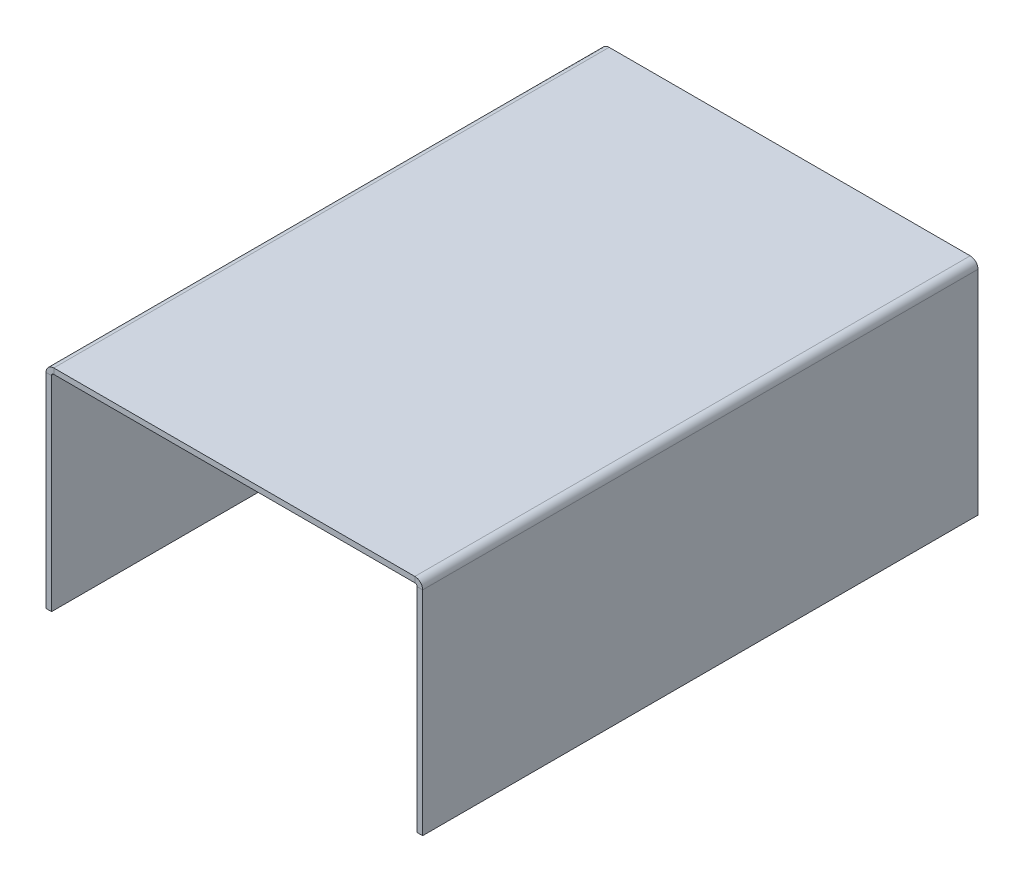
ISO-10303-21;
HEADER;
FILE_DESCRIPTION(('STEP AP214'),'2;1');
FILE_NAME('part.step','',(''),(''),'','','');
FILE_SCHEMA(('AUTOMOTIVE_DESIGN { 1 0 10303 214 1 1 1 1 }'));
ENDSEC;
DATA;
#1=APPLICATION_CONTEXT('core data for automotive mechanical design processes');
#2=APPLICATION_PROTOCOL_DEFINITION('international standard','automotive_design',2000,#1);
#3=PRODUCT_CONTEXT('',#1,'mechanical');
#4=PRODUCT('Part','Part','',(#3));
#5=PRODUCT_RELATED_PRODUCT_CATEGORY('part','',(#4));
#6=PRODUCT_DEFINITION_FORMATION('','',#4);
#7=PRODUCT_DEFINITION_CONTEXT('part definition',#1,'design');
#8=PRODUCT_DEFINITION('design','',#6,#7);
#9=PRODUCT_DEFINITION_SHAPE('','',#8);
#10=(LENGTH_UNIT() NAMED_UNIT(*) SI_UNIT(.MILLI.,.METRE.));
#11=(NAMED_UNIT(*) PLANE_ANGLE_UNIT() SI_UNIT($,.RADIAN.));
#12=(NAMED_UNIT(*) SI_UNIT($,.STERADIAN.) SOLID_ANGLE_UNIT());
#13=UNCERTAINTY_MEASURE_WITH_UNIT(LENGTH_MEASURE(1.E-05),#10,'distance_accuracy_value','');
#14=(GEOMETRIC_REPRESENTATION_CONTEXT(3) GLOBAL_UNCERTAINTY_ASSIGNED_CONTEXT((#13)) GLOBAL_UNIT_ASSIGNED_CONTEXT((#10,
#11,#12)) REPRESENTATION_CONTEXT('',''));
#15=CARTESIAN_POINT('',(0.,0.,0.));
#16=DIRECTION('',(0.,0.,1.));
#17=DIRECTION('',(1.,0.,0.));
#18=AXIS2_PLACEMENT_3D('',#15,#16,#17);
#19=CARTESIAN_POINT('',(-82.5763046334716,97.0504840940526,127.));
#20=DIRECTION('',(0.,0.,1.));
#21=DIRECTION('',(1.,0.,0.));
#22=AXIS2_PLACEMENT_3D('',#19,#20,#21);
#23=PLANE('',#22);
#24=DIRECTION('',(0.,-1.,0.));
#25=VECTOR('',#24,1.);
#26=CARTESIAN_POINT('',(-82.5763046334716,97.0504840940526,127.));
#27=LINE('',#26,#25);
#28=CARTESIAN_POINT('',(-82.5763046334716,97.0504840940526,127.));
#29=VERTEX_POINT('',#28);
#30=CARTESIAN_POINT('',(-82.5763046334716,94.5104840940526,127.));
#31=VERTEX_POINT('',#30);
#32=EDGE_CURVE('E11',#29,#31,#27,.T.);
#33=ORIENTED_EDGE('',*,*,#32,.F.);
#34=CARTESIAN_POINT('',(-82.5763046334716,93.4944840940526,127.));
#35=DIRECTION('',(0.,0.,1.));
#36=DIRECTION('',(1.,0.,0.));
#37=AXIS2_PLACEMENT_3D('',#34,#35,#36);
#38=CIRCLE('',#37,3.556);
#39=CARTESIAN_POINT('',(-86.1323046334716,93.4944840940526,127.));
#40=VERTEX_POINT('',#39);
#41=EDGE_CURVE('E189',#40,#29,#38,.F.);
#42=ORIENTED_EDGE('',*,*,#41,.F.);
#43=DIRECTION('',(-1.,0.,0.));
#44=VECTOR('',#43,1.);
#45=CARTESIAN_POINT('',(-83.5923046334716,93.4944840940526,127.));
#46=LINE('',#45,#44);
#47=CARTESIAN_POINT('',(-83.5923046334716,93.4944840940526,127.));
#48=VERTEX_POINT('',#47);
#49=EDGE_CURVE('E42',#48,#40,#46,.T.);
#50=ORIENTED_EDGE('',*,*,#49,.F.);
#51=CARTESIAN_POINT('',(-82.5763046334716,93.4944840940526,127.));
#52=DIRECTION('',(0.,0.,1.));
#53=DIRECTION('',(1.,0.,0.));
#54=AXIS2_PLACEMENT_3D('',#51,#52,#53);
#55=CIRCLE('',#54,1.016);
#56=EDGE_CURVE('E201',#48,#31,#55,.F.);
#57=ORIENTED_EDGE('',*,*,#56,.T.);
#58=EDGE_LOOP('',(#33,#42,#50,#57));
#59=FACE_BOUND('',#58,.T.);
#60=ADVANCED_FACE('F35',(#59),#23,.T.);
#61=CARTESIAN_POINT('',(-83.5923046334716,93.4944840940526,127.));
#62=DIRECTION('',(0.,0.,1.));
#63=DIRECTION('',(1.,0.,0.));
#64=AXIS2_PLACEMENT_3D('',#61,#62,#63);
#65=PLANE('',#64);
#66=DIRECTION('',(1.,0.,0.));
#67=VECTOR('',#66,1.);
#68=CARTESIAN_POINT('',(-86.1323046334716,97.0504840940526,127.));
#69=LINE('',#68,#67);
#70=CARTESIAN_POINT('',(82.5763046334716,97.0504840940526,127.));
#71=VERTEX_POINT('',#70);
#72=EDGE_CURVE('E186',#29,#71,#69,.T.);
#73=ORIENTED_EDGE('',*,*,#72,.F.);
#74=ORIENTED_EDGE('',*,*,#32,.T.);
#75=DIRECTION('',(1.,0.,0.));
#76=VECTOR('',#75,1.);
#77=CARTESIAN_POINT('',(-86.1323046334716,94.5104840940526,127.));
#78=LINE('',#77,#76);
#79=CARTESIAN_POINT('',(82.5763046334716,94.5104840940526,127.));
#80=VERTEX_POINT('',#79);
#81=EDGE_CURVE('E204',#31,#80,#78,.T.);
#82=ORIENTED_EDGE('',*,*,#81,.T.);
#83=DIRECTION('',(0.,1.,0.));
#84=VECTOR('',#83,1.);
#85=CARTESIAN_POINT('',(82.5763046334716,94.5104840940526,127.));
#86=LINE('',#85,#84);
#87=EDGE_CURVE('E56',#80,#71,#86,.T.);
#88=ORIENTED_EDGE('',*,*,#87,.T.);
#89=EDGE_LOOP('',(#73,#74,#82,#88));
#90=FACE_BOUND('',#89,.T.);
#91=ADVANCED_FACE('F280',(#90),#65,.T.);
#92=CARTESIAN_POINT('',(-86.1323046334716,93.4944840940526,-127.));
#93=DIRECTION('',(0.,0.,-1.));
#94=DIRECTION('',(-1.,0.,0.));
#95=AXIS2_PLACEMENT_3D('',#92,#93,#94);
#96=PLANE('',#95);
#97=DIRECTION('',(1.,0.,0.));
#98=VECTOR('',#97,1.);
#99=CARTESIAN_POINT('',(-86.1323046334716,93.4944840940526,-127.));
#100=LINE('',#99,#98);
#101=CARTESIAN_POINT('',(-86.1323046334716,93.4944840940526,-127.));
#102=VERTEX_POINT('',#101);
#103=CARTESIAN_POINT('',(-83.5923046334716,93.4944840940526,-127.));
#104=VERTEX_POINT('',#103);
#105=EDGE_CURVE('E242',#102,#104,#100,.T.);
#106=ORIENTED_EDGE('',*,*,#105,.F.);
#107=CARTESIAN_POINT('',(-82.5763046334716,93.4944840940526,-127.));
#108=DIRECTION('',(0.,0.,1.));
#109=DIRECTION('',(1.,0.,0.));
#110=AXIS2_PLACEMENT_3D('',#107,#108,#109);
#111=CIRCLE('',#110,3.556);
#112=CARTESIAN_POINT('',(-82.5763046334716,97.0504840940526,-127.));
#113=VERTEX_POINT('',#112);
#114=EDGE_CURVE('E157',#102,#113,#111,.F.);
#115=ORIENTED_EDGE('',*,*,#114,.T.);
#116=DIRECTION('',(0.,1.,0.));
#117=VECTOR('',#116,1.);
#118=CARTESIAN_POINT('',(-82.5763046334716,94.5104840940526,-127.));
#119=LINE('',#118,#117);
#120=CARTESIAN_POINT('',(-82.5763046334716,94.5104840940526,-127.));
#121=VERTEX_POINT('',#120);
#122=EDGE_CURVE('E240',#121,#113,#119,.T.);
#123=ORIENTED_EDGE('',*,*,#122,.F.);
#124=CARTESIAN_POINT('',(-82.5763046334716,93.4944840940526,-127.));
#125=DIRECTION('',(0.,0.,1.));
#126=DIRECTION('',(1.,0.,0.));
#127=AXIS2_PLACEMENT_3D('',#124,#125,#126);
#128=CIRCLE('',#127,1.016);
#129=EDGE_CURVE('E169',#104,#121,#128,.F.);
#130=ORIENTED_EDGE('',*,*,#129,.F.);
#131=EDGE_LOOP('',(#106,#115,#123,#130));
#132=FACE_BOUND('',#131,.T.);
#133=ADVANCED_FACE('F286',(#132),#96,.T.);
#134=CARTESIAN_POINT('',(-82.5763046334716,94.5104840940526,-127.));
#135=DIRECTION('',(0.,0.,-1.));
#136=DIRECTION('',(-1.,0.,0.));
#137=AXIS2_PLACEMENT_3D('',#134,#135,#136);
#138=PLANE('',#137);
#139=DIRECTION('',(0.,1.,0.));
#140=VECTOR('',#139,1.);
#141=CARTESIAN_POINT('',(-86.1323046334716,0.,-127.));
#142=LINE('',#141,#140);
#143=CARTESIAN_POINT('',(-86.1323046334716,0.,-127.));
#144=VERTEX_POINT('',#143);
#145=EDGE_CURVE('E160',#144,#102,#142,.T.);
#146=ORIENTED_EDGE('',*,*,#145,.T.);
#147=ORIENTED_EDGE('',*,*,#105,.T.);
#148=DIRECTION('',(0.,1.,0.));
#149=VECTOR('',#148,1.);
#150=CARTESIAN_POINT('',(-83.5923046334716,0.,-127.));
#151=LINE('',#150,#149);
#152=CARTESIAN_POINT('',(-83.5923046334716,0.,-127.));
#153=VERTEX_POINT('',#152);
#154=EDGE_CURVE('E166',#153,#104,#151,.T.);
#155=ORIENTED_EDGE('',*,*,#154,.F.);
#156=DIRECTION('',(-1.,0.,0.));
#157=VECTOR('',#156,1.);
#158=CARTESIAN_POINT('',(-83.5923046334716,0.,-127.));
#159=LINE('',#158,#157);
#160=EDGE_CURVE('E163',#153,#144,#159,.T.);
#161=ORIENTED_EDGE('',*,*,#160,.T.);
#162=EDGE_LOOP('',(#146,#147,#155,#161));
#163=FACE_BOUND('',#162,.T.);
#164=ADVANCED_FACE('F264',(#163),#138,.T.);
#165=CARTESIAN_POINT('',(86.1323046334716,93.4944840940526,127.));
#166=DIRECTION('',(0.,0.,1.));
#167=DIRECTION('',(1.,0.,0.));
#168=AXIS2_PLACEMENT_3D('',#165,#166,#167);
#169=PLANE('',#168);
#170=DIRECTION('',(-1.,0.,0.));
#171=VECTOR('',#170,1.);
#172=CARTESIAN_POINT('',(86.1323046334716,93.4944840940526,127.));
#173=LINE('',#172,#171);
#174=CARTESIAN_POINT('',(86.1323046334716,93.4944840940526,127.));
#175=VERTEX_POINT('',#174);
#176=CARTESIAN_POINT('',(83.5923046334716,93.4944840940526,127.));
#177=VERTEX_POINT('',#176);
#178=EDGE_CURVE('E49',#175,#177,#173,.T.);
#179=ORIENTED_EDGE('',*,*,#178,.F.);
#180=CARTESIAN_POINT('',(82.5763046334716,93.4944840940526,127.));
#181=DIRECTION('',(0.,0.,1.));
#182=DIRECTION('',(1.,0.,0.));
#183=AXIS2_PLACEMENT_3D('',#180,#181,#182);
#184=CIRCLE('',#183,3.556);
#185=EDGE_CURVE('E183',#71,#175,#184,.F.);
#186=ORIENTED_EDGE('',*,*,#185,.F.);
#187=ORIENTED_EDGE('',*,*,#87,.F.);
#188=CARTESIAN_POINT('',(82.5763046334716,93.4944840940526,127.));
#189=DIRECTION('',(0.,0.,1.));
#190=DIRECTION('',(1.,0.,0.));
#191=AXIS2_PLACEMENT_3D('',#188,#189,#190);
#192=CIRCLE('',#191,1.016);
#193=EDGE_CURVE('E206',#80,#177,#192,.F.);
#194=ORIENTED_EDGE('',*,*,#193,.T.);
#195=EDGE_LOOP('',(#179,#186,#187,#194));
#196=FACE_BOUND('',#195,.T.);
#197=ADVANCED_FACE('F295',(#196),#169,.T.);
#198=CARTESIAN_POINT('',(82.5763046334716,94.5104840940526,127.));
#199=DIRECTION('',(0.,0.,1.));
#200=DIRECTION('',(1.,0.,0.));
#201=AXIS2_PLACEMENT_3D('',#198,#199,#200);
#202=PLANE('',#201);
#203=DIRECTION('',(0.,-1.,0.));
#204=VECTOR('',#203,1.);
#205=CARTESIAN_POINT('',(86.1323046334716,97.0504840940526,127.));
#206=LINE('',#205,#204);
#207=CARTESIAN_POINT('',(86.1323046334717,-3.88201936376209,127.));
#208=VERTEX_POINT('',#207);
#209=EDGE_CURVE('E180',#175,#208,#206,.T.);
#210=ORIENTED_EDGE('',*,*,#209,.F.);
#211=ORIENTED_EDGE('',*,*,#178,.T.);
#212=DIRECTION('',(0.,-1.,0.));
#213=VECTOR('',#212,1.);
#214=CARTESIAN_POINT('',(83.5923046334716,97.0504840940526,127.));
#215=LINE('',#214,#213);
#216=CARTESIAN_POINT('',(83.5923046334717,-3.88201936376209,127.));
#217=VERTEX_POINT('',#216);
#218=EDGE_CURVE('E177',#177,#217,#215,.T.);
#219=ORIENTED_EDGE('',*,*,#218,.T.);
#220=DIRECTION('',(-1.,0.,0.));
#221=VECTOR('',#220,1.);
#222=CARTESIAN_POINT('',(86.1323046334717,-3.88201936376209,127.));
#223=LINE('',#222,#221);
#224=EDGE_CURVE('E128',#208,#217,#223,.T.);
#225=ORIENTED_EDGE('',*,*,#224,.F.);
#226=EDGE_LOOP('',(#210,#211,#219,#225));
#227=FACE_BOUND('',#226,.T.);
#228=ADVANCED_FACE('F300',(#227),#202,.T.);
#229=CARTESIAN_POINT('',(82.5763046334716,97.0504840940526,-127.));
#230=DIRECTION('',(0.,0.,-1.));
#231=DIRECTION('',(-1.,0.,0.));
#232=AXIS2_PLACEMENT_3D('',#229,#230,#231);
#233=PLANE('',#232);
#234=DIRECTION('',(0.,-1.,0.));
#235=VECTOR('',#234,1.);
#236=CARTESIAN_POINT('',(82.5763046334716,97.0504840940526,-127.));
#237=LINE('',#236,#235);
#238=CARTESIAN_POINT('',(82.5763046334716,97.0504840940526,-127.));
#239=VERTEX_POINT('',#238);
#240=CARTESIAN_POINT('',(82.5763046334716,94.5104840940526,-127.));
#241=VERTEX_POINT('',#240);
#242=EDGE_CURVE('E236',#239,#241,#237,.T.);
#243=ORIENTED_EDGE('',*,*,#242,.F.);
#244=CARTESIAN_POINT('',(82.5763046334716,93.4944840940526,-127.));
#245=DIRECTION('',(0.,0.,1.));
#246=DIRECTION('',(1.,0.,0.));
#247=AXIS2_PLACEMENT_3D('',#244,#245,#246);
#248=CIRCLE('',#247,3.556);
#249=CARTESIAN_POINT('',(86.1323046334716,93.4944840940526,-127.));
#250=VERTEX_POINT('',#249);
#251=EDGE_CURVE('E151',#239,#250,#248,.F.);
#252=ORIENTED_EDGE('',*,*,#251,.T.);
#253=DIRECTION('',(1.,0.,0.));
#254=VECTOR('',#253,1.);
#255=CARTESIAN_POINT('',(83.5923046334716,93.4944840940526,-127.));
#256=LINE('',#255,#254);
#257=CARTESIAN_POINT('',(83.5923046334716,93.4944840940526,-127.));
#258=VERTEX_POINT('',#257);
#259=EDGE_CURVE('E132',#258,#250,#256,.T.);
#260=ORIENTED_EDGE('',*,*,#259,.F.);
#261=CARTESIAN_POINT('',(82.5763046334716,93.4944840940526,-127.));
#262=DIRECTION('',(0.,0.,1.));
#263=DIRECTION('',(1.,0.,0.));
#264=AXIS2_PLACEMENT_3D('',#261,#262,#263);
#265=CIRCLE('',#264,1.016);
#266=EDGE_CURVE('E175',#241,#258,#265,.F.);
#267=ORIENTED_EDGE('',*,*,#266,.F.);
#268=EDGE_LOOP('',(#243,#252,#260,#267));
#269=FACE_BOUND('',#268,.T.);
#270=ADVANCED_FACE('F292',(#269),#233,.T.);
#271=CARTESIAN_POINT('',(83.5923046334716,93.4944840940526,-127.));
#272=DIRECTION('',(0.,0.,-1.));
#273=DIRECTION('',(-1.,0.,0.));
#274=AXIS2_PLACEMENT_3D('',#271,#272,#273);
#275=PLANE('',#274);
#276=DIRECTION('',(1.,0.,0.));
#277=VECTOR('',#276,1.);
#278=CARTESIAN_POINT('',(-86.1323046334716,97.0504840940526,-127.));
#279=LINE('',#278,#277);
#280=EDGE_CURVE('E154',#113,#239,#279,.T.);
#281=ORIENTED_EDGE('',*,*,#280,.T.);
#282=ORIENTED_EDGE('',*,*,#242,.T.);
#283=DIRECTION('',(1.,0.,0.));
#284=VECTOR('',#283,1.);
#285=CARTESIAN_POINT('',(-86.1323046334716,94.5104840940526,-127.));
#286=LINE('',#285,#284);
#287=EDGE_CURVE('E172',#121,#241,#286,.T.);
#288=ORIENTED_EDGE('',*,*,#287,.F.);
#289=ORIENTED_EDGE('',*,*,#122,.T.);
#290=EDGE_LOOP('',(#281,#282,#288,#289));
#291=FACE_BOUND('',#290,.T.);
#292=ADVANCED_FACE('F288',(#291),#275,.T.);
#293=CARTESIAN_POINT('',(83.5923046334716,97.0504840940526,127.));
#294=DIRECTION('',(1.,0.,0.));
#295=DIRECTION('',(0.,1.,0.));
#296=AXIS2_PLACEMENT_3D('',#293,#294,#295);
#297=PLANE('',#296);
#298=DIRECTION('',(0.,0.,-1.));
#299=VECTOR('',#298,1.);
#300=CARTESIAN_POINT('',(83.5923046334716,93.4944840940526,127.));
#301=LINE('',#300,#299);
#302=EDGE_CURVE('E147',#177,#258,#301,.T.);
#303=ORIENTED_EDGE('',*,*,#302,.T.);
#304=DIRECTION('',(0.,-1.,0.));
#305=VECTOR('',#304,1.);
#306=CARTESIAN_POINT('',(83.5923046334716,97.0504840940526,-127.));
#307=LINE('',#306,#305);
#308=CARTESIAN_POINT('',(83.5923046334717,-3.88201936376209,-127.));
#309=VERTEX_POINT('',#308);
#310=EDGE_CURVE('E139',#258,#309,#307,.T.);
#311=ORIENTED_EDGE('',*,*,#310,.T.);
#312=DIRECTION('',(0.,0.,-1.));
#313=VECTOR('',#312,1.);
#314=CARTESIAN_POINT('',(83.5923046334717,-3.88201936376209,127.));
#315=LINE('',#314,#313);
#316=EDGE_CURVE('E123',#217,#309,#315,.T.);
#317=ORIENTED_EDGE('',*,*,#316,.F.);
#318=ORIENTED_EDGE('',*,*,#218,.F.);
#319=EDGE_LOOP('',(#303,#311,#317,#318));
#320=FACE_BOUND('',#319,.T.);
#321=ADVANCED_FACE('F145',(#320),#297,.F.);
#322=CARTESIAN_POINT('',(86.1323046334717,-3.88201936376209,127.));
#323=DIRECTION('',(0.,-1.,0.));
#324=DIRECTION('',(1.,0.,0.));
#325=AXIS2_PLACEMENT_3D('',#322,#323,#324);
#326=PLANE('',#325);
#327=ORIENTED_EDGE('',*,*,#316,.T.);
#328=DIRECTION('',(-1.,0.,0.));
#329=VECTOR('',#328,1.);
#330=CARTESIAN_POINT('',(86.1323046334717,-3.88201936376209,-127.));
#331=LINE('',#330,#329);
#332=CARTESIAN_POINT('',(86.1323046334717,-3.88201936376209,-127.));
#333=VERTEX_POINT('',#332);
#334=EDGE_CURVE('E126',#333,#309,#331,.T.);
#335=ORIENTED_EDGE('',*,*,#334,.F.);
#336=DIRECTION('',(0.,0.,-1.));
#337=VECTOR('',#336,1.);
#338=CARTESIAN_POINT('',(86.1323046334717,-3.88201936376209,127.));
#339=LINE('',#338,#337);
#340=EDGE_CURVE('E133',#208,#333,#339,.T.);
#341=ORIENTED_EDGE('',*,*,#340,.F.);
#342=ORIENTED_EDGE('',*,*,#224,.T.);
#343=EDGE_LOOP('',(#327,#335,#341,#342));
#344=FACE_BOUND('',#343,.T.);
#345=ADVANCED_FACE('F125',(#344),#326,.T.);
#346=CARTESIAN_POINT('',(86.1323046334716,97.0504840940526,127.));
#347=DIRECTION('',(1.,0.,0.));
#348=DIRECTION('',(0.,1.,0.));
#349=AXIS2_PLACEMENT_3D('',#346,#347,#348);
#350=PLANE('',#349);
#351=ORIENTED_EDGE('',*,*,#340,.T.);
#352=DIRECTION('',(0.,-1.,0.));
#353=VECTOR('',#352,1.);
#354=CARTESIAN_POINT('',(86.1323046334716,97.0504840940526,-127.));
#355=LINE('',#354,#353);
#356=EDGE_CURVE('E142',#250,#333,#355,.T.);
#357=ORIENTED_EDGE('',*,*,#356,.F.);
#358=DIRECTION('',(0.,0.,-1.));
#359=VECTOR('',#358,1.);
#360=CARTESIAN_POINT('',(86.1323046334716,93.4944840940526,127.));
#361=LINE('',#360,#359);
#362=EDGE_CURVE('E231',#175,#250,#361,.T.);
#363=ORIENTED_EDGE('',*,*,#362,.F.);
#364=ORIENTED_EDGE('',*,*,#209,.T.);
#365=EDGE_LOOP('',(#351,#357,#363,#364));
#366=FACE_BOUND('',#365,.T.);
#367=ADVANCED_FACE('F298',(#366),#350,.T.);
#368=CARTESIAN_POINT('',(82.5763046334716,93.4944840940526,127.));
#369=DIRECTION('',(0.,0.,-1.));
#370=DIRECTION('',(-1.,0.,0.));
#371=AXIS2_PLACEMENT_3D('',#368,#369,#370);
#372=CYLINDRICAL_SURFACE('',#371,3.556);
#373=ORIENTED_EDGE('',*,*,#362,.T.);
#374=ORIENTED_EDGE('',*,*,#251,.F.);
#375=DIRECTION('',(0.,0.,-1.));
#376=VECTOR('',#375,1.);
#377=CARTESIAN_POINT('',(82.5763046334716,97.0504840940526,127.));
#378=LINE('',#377,#376);
#379=EDGE_CURVE('E228',#71,#239,#378,.T.);
#380=ORIENTED_EDGE('',*,*,#379,.F.);
#381=ORIENTED_EDGE('',*,*,#185,.T.);
#382=EDGE_LOOP('',(#373,#374,#380,#381));
#383=FACE_BOUND('',#382,.T.);
#384=ADVANCED_FACE('F301',(#383),#372,.T.);
#385=CARTESIAN_POINT('',(-86.1323046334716,97.0504840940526,127.));
#386=DIRECTION('',(0.,1.,0.));
#387=DIRECTION('',(0.,0.,1.));
#388=AXIS2_PLACEMENT_3D('',#385,#386,#387);
#389=PLANE('',#388);
#390=ORIENTED_EDGE('',*,*,#379,.T.);
#391=ORIENTED_EDGE('',*,*,#280,.F.);
#392=DIRECTION('',(0.,0.,-1.));
#393=VECTOR('',#392,1.);
#394=CARTESIAN_POINT('',(-82.5763046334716,97.0504840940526,127.));
#395=LINE('',#394,#393);
#396=EDGE_CURVE('E225',#29,#113,#395,.T.);
#397=ORIENTED_EDGE('',*,*,#396,.F.);
#398=ORIENTED_EDGE('',*,*,#72,.T.);
#399=EDGE_LOOP('',(#390,#391,#397,#398));
#400=FACE_BOUND('',#399,.T.);
#401=ADVANCED_FACE('F283',(#400),#389,.T.);
#402=CARTESIAN_POINT('',(-82.5763046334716,93.4944840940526,127.));
#403=DIRECTION('',(0.,0.,-1.));
#404=DIRECTION('',(-1.,0.,0.));
#405=AXIS2_PLACEMENT_3D('',#402,#403,#404);
#406=CYLINDRICAL_SURFACE('',#405,3.556);
#407=ORIENTED_EDGE('',*,*,#396,.T.);
#408=ORIENTED_EDGE('',*,*,#114,.F.);
#409=DIRECTION('',(0.,0.,-1.));
#410=VECTOR('',#409,1.);
#411=CARTESIAN_POINT('',(-86.1323046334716,93.4944840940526,127.));
#412=LINE('',#411,#410);
#413=EDGE_CURVE('E222',#40,#102,#412,.T.);
#414=ORIENTED_EDGE('',*,*,#413,.F.);
#415=ORIENTED_EDGE('',*,*,#41,.T.);
#416=EDGE_LOOP('',(#407,#408,#414,#415));
#417=FACE_BOUND('',#416,.T.);
#418=ADVANCED_FACE('F254',(#417),#406,.T.);
#419=CARTESIAN_POINT('',(-86.1323046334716,0.,127.));
#420=DIRECTION('',(-1.,0.,0.));
#421=DIRECTION('',(0.,0.,1.));
#422=AXIS2_PLACEMENT_3D('',#419,#420,#421);
#423=PLANE('',#422);
#424=ORIENTED_EDGE('',*,*,#413,.T.);
#425=ORIENTED_EDGE('',*,*,#145,.F.);
#426=DIRECTION('',(0.,0.,-1.));
#427=VECTOR('',#426,1.);
#428=CARTESIAN_POINT('',(-86.1323046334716,0.,127.));
#429=LINE('',#428,#427);
#430=CARTESIAN_POINT('',(-86.1323046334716,0.,127.));
#431=VERTEX_POINT('',#430);
#432=EDGE_CURVE('E220',#431,#144,#429,.T.);
#433=ORIENTED_EDGE('',*,*,#432,.F.);
#434=DIRECTION('',(0.,1.,0.));
#435=VECTOR('',#434,1.);
#436=CARTESIAN_POINT('',(-86.1323046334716,0.,127.));
#437=LINE('',#436,#435);
#438=EDGE_CURVE('E192',#431,#40,#437,.T.);
#439=ORIENTED_EDGE('',*,*,#438,.T.);
#440=EDGE_LOOP('',(#424,#425,#433,#439));
#441=FACE_BOUND('',#440,.T.);
#442=ADVANCED_FACE('F258',(#441),#423,.T.);
#443=CARTESIAN_POINT('',(-83.5923046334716,0.,127.));
#444=DIRECTION('',(0.,-1.,0.));
#445=DIRECTION('',(0.,0.,-1.));
#446=AXIS2_PLACEMENT_3D('',#443,#444,#445);
#447=PLANE('',#446);
#448=ORIENTED_EDGE('',*,*,#432,.T.);
#449=ORIENTED_EDGE('',*,*,#160,.F.);
#450=DIRECTION('',(0.,0.,-1.));
#451=VECTOR('',#450,1.);
#452=CARTESIAN_POINT('',(-83.5923046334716,0.,127.));
#453=LINE('',#452,#451);
#454=CARTESIAN_POINT('',(-83.5923046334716,0.,127.));
#455=VERTEX_POINT('',#454);
#456=EDGE_CURVE('E218',#455,#153,#453,.T.);
#457=ORIENTED_EDGE('',*,*,#456,.F.);
#458=DIRECTION('',(-1.,0.,0.));
#459=VECTOR('',#458,1.);
#460=CARTESIAN_POINT('',(-83.5923046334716,0.,127.));
#461=LINE('',#460,#459);
#462=EDGE_CURVE('E195',#455,#431,#461,.T.);
#463=ORIENTED_EDGE('',*,*,#462,.T.);
#464=EDGE_LOOP('',(#448,#449,#457,#463));
#465=FACE_BOUND('',#464,.T.);
#466=ADVANCED_FACE('F261',(#465),#447,.T.);
#467=CARTESIAN_POINT('',(-83.5923046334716,0.,127.));
#468=DIRECTION('',(-1.,0.,0.));
#469=DIRECTION('',(0.,0.,1.));
#470=AXIS2_PLACEMENT_3D('',#467,#468,#469);
#471=PLANE('',#470);
#472=ORIENTED_EDGE('',*,*,#456,.T.);
#473=ORIENTED_EDGE('',*,*,#154,.T.);
#474=DIRECTION('',(0.,0.,-1.));
#475=VECTOR('',#474,1.);
#476=CARTESIAN_POINT('',(-83.5923046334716,93.4944840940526,127.));
#477=LINE('',#476,#475);
#478=EDGE_CURVE('E215',#48,#104,#477,.T.);
#479=ORIENTED_EDGE('',*,*,#478,.F.);
#480=DIRECTION('',(0.,1.,0.));
#481=VECTOR('',#480,1.);
#482=CARTESIAN_POINT('',(-83.5923046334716,0.,127.));
#483=LINE('',#482,#481);
#484=EDGE_CURVE('E198',#455,#48,#483,.T.);
#485=ORIENTED_EDGE('',*,*,#484,.F.);
#486=EDGE_LOOP('',(#472,#473,#479,#485));
#487=FACE_BOUND('',#486,.T.);
#488=ADVANCED_FACE('F266',(#487),#471,.F.);
#489=CARTESIAN_POINT('',(-82.5763046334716,93.4944840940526,127.));
#490=DIRECTION('',(0.,0.,-1.));
#491=DIRECTION('',(-1.,0.,0.));
#492=AXIS2_PLACEMENT_3D('',#489,#490,#491);
#493=CYLINDRICAL_SURFACE('',#492,1.016);
#494=ORIENTED_EDGE('',*,*,#478,.T.);
#495=ORIENTED_EDGE('',*,*,#129,.T.);
#496=DIRECTION('',(0.,0.,-1.));
#497=VECTOR('',#496,1.);
#498=CARTESIAN_POINT('',(-82.5763046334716,94.5104840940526,127.));
#499=LINE('',#498,#497);
#500=EDGE_CURVE('E212',#31,#121,#499,.T.);
#501=ORIENTED_EDGE('',*,*,#500,.F.);
#502=ORIENTED_EDGE('',*,*,#56,.F.);
#503=EDGE_LOOP('',(#494,#495,#501,#502));
#504=FACE_BOUND('',#503,.T.);
#505=ADVANCED_FACE('F271',(#504),#493,.F.);
#506=CARTESIAN_POINT('',(-86.1323046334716,94.5104840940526,127.));
#507=DIRECTION('',(0.,1.,0.));
#508=DIRECTION('',(0.,0.,1.));
#509=AXIS2_PLACEMENT_3D('',#506,#507,#508);
#510=PLANE('',#509);
#511=ORIENTED_EDGE('',*,*,#500,.T.);
#512=ORIENTED_EDGE('',*,*,#287,.T.);
#513=DIRECTION('',(0.,0.,-1.));
#514=VECTOR('',#513,1.);
#515=CARTESIAN_POINT('',(82.5763046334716,94.5104840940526,127.));
#516=LINE('',#515,#514);
#517=EDGE_CURVE('E209',#80,#241,#516,.T.);
#518=ORIENTED_EDGE('',*,*,#517,.F.);
#519=ORIENTED_EDGE('',*,*,#81,.F.);
#520=EDGE_LOOP('',(#511,#512,#518,#519));
#521=FACE_BOUND('',#520,.T.);
#522=ADVANCED_FACE('F276',(#521),#510,.F.);
#523=CARTESIAN_POINT('',(82.5763046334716,93.4944840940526,127.));
#524=DIRECTION('',(0.,0.,-1.));
#525=DIRECTION('',(-1.,0.,0.));
#526=AXIS2_PLACEMENT_3D('',#523,#524,#525);
#527=CYLINDRICAL_SURFACE('',#526,1.016);
#528=ORIENTED_EDGE('',*,*,#517,.T.);
#529=ORIENTED_EDGE('',*,*,#266,.T.);
#530=ORIENTED_EDGE('',*,*,#302,.F.);
#531=ORIENTED_EDGE('',*,*,#193,.F.);
#532=EDGE_LOOP('',(#528,#529,#530,#531));
#533=FACE_BOUND('',#532,.T.);
#534=ADVANCED_FACE('F294',(#533),#527,.F.);
#535=CARTESIAN_POINT('',(82.5763046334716,93.4944840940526,127.));
#536=DIRECTION('',(0.,0.,1.));
#537=DIRECTION('',(1.,0.,0.));
#538=AXIS2_PLACEMENT_3D('',#535,#536,#537);
#539=PLANE('',#538);
#540=ORIENTED_EDGE('',*,*,#484,.T.);
#541=ORIENTED_EDGE('',*,*,#49,.T.);
#542=ORIENTED_EDGE('',*,*,#438,.F.);
#543=ORIENTED_EDGE('',*,*,#462,.F.);
#544=EDGE_LOOP('',(#540,#541,#542,#543));
#545=FACE_BOUND('',#544,.T.);
#546=ADVANCED_FACE('F246',(#545),#539,.T.);
#547=CARTESIAN_POINT('',(82.5763046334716,93.4944840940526,-127.));
#548=DIRECTION('',(0.,0.,1.));
#549=DIRECTION('',(1.,0.,0.));
#550=AXIS2_PLACEMENT_3D('',#547,#548,#549);
#551=PLANE('',#550);
#552=ORIENTED_EDGE('',*,*,#310,.F.);
#553=ORIENTED_EDGE('',*,*,#259,.T.);
#554=ORIENTED_EDGE('',*,*,#356,.T.);
#555=ORIENTED_EDGE('',*,*,#334,.T.);
#556=EDGE_LOOP('',(#552,#553,#554,#555));
#557=FACE_BOUND('',#556,.T.);
#558=ADVANCED_FACE('F138',(#557),#551,.F.);
#559=CLOSED_SHELL('',(#60,#91,#133,#164,#197,#228,#270,#292,#321,#345,#367,#384,#401,#418,#442,
#466,#488,#505,#522,#534,#546,#558));
#560=MANIFOLD_SOLID_BREP('B2',#559);
#561=ADVANCED_BREP_SHAPE_REPRESENTATION('',(#18,#560),#14);
#562=SHAPE_DEFINITION_REPRESENTATION(#9,#561);
ENDSEC;
END-ISO-10303-21;
